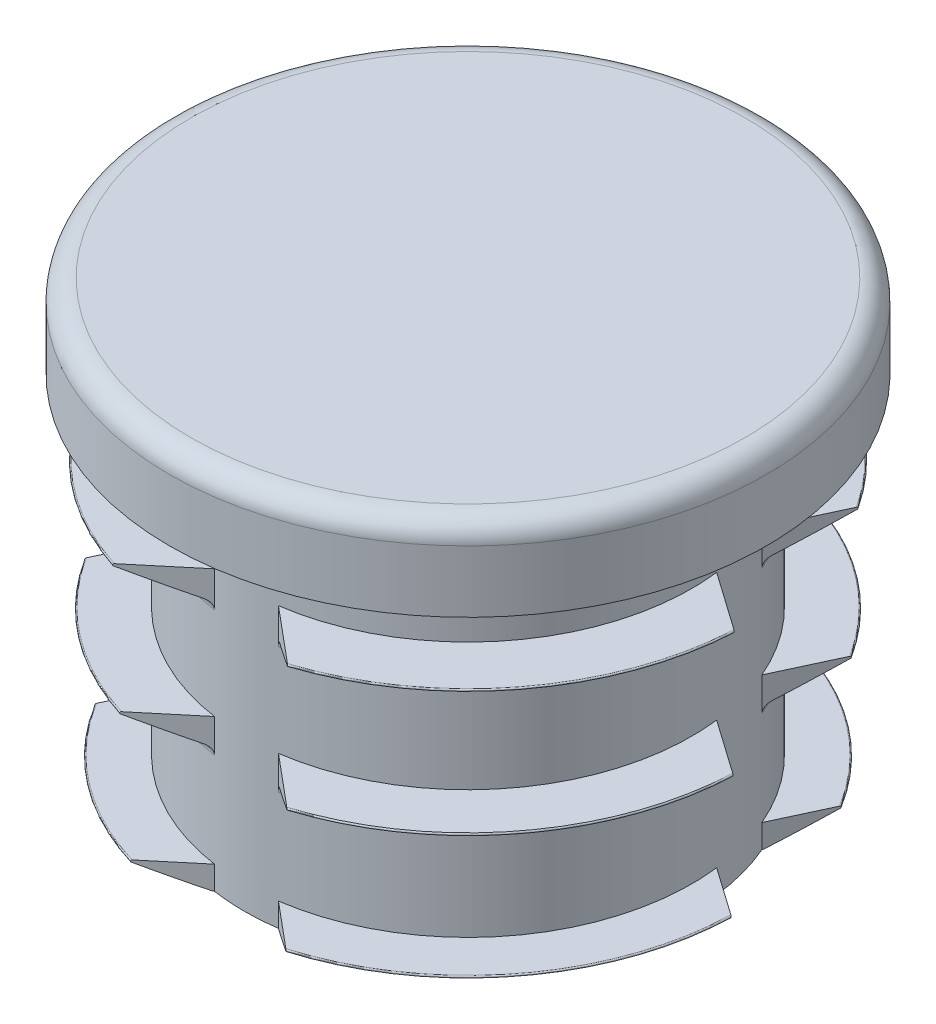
from build123d import *

# Parameters (mm, degrees)
SKETCH_1_R                      = 14
EXTRUDE_1_DEPTH                 = 1.95
SKETCH_2_R                      = 10.5
SKETCH_2_R_2                    = 8.5
EXTRUDE_2_DEPTH                 = 16.6
FILLET_1_R                      = 1
FILLET_2_R                      = 0.05
FILLET_3_R                      = 0.5
CUT_EXTRUDE_1_REACH             = 30.5
PATTERN_CIRCULAR_1_COUNT        = 2
PATTERN_CIRCULAR_1_ANGLE        = 75
PATTERN_CIRCULAR_2_COUNT        = 2
PATTERN_CIRCULAR_2_COPY_1_REACH = 30.5


with BuildPart() as part:
    # Sketch 1 → Extrude 1 (new, symmetric)
    with BuildSketch(Plane(origin=(0, 0, 0), x_dir=(1, 0, 0), z_dir=(0, 1, 0))):
        with Locations(Location((0, 0, 0), (0, 0, 270))):
            Circle(SKETCH_1_R)
    extrude(amount=EXTRUDE_1_DEPTH, both=True)

    # Sketch 2 → Extrude 2 (add)
    with BuildSketch(Plane.XZ.offset(1.95)):
        with Locations(Location((0, 0, 0), (0, 0, 90))):
            Circle(SKETCH_2_R)
        with Locations(Location((0, 0, 0), (0, 0, 90))):
            Circle(SKETCH_2_R_2, mode=Mode.SUBTRACT)
    extrude(amount=EXTRUDE_2_DEPTH)

    # Sketch 3 → Revolve 1 (revolve)
    with BuildSketch(Plane(origin=(0, 0, 0), x_dir=(0, 0, -1), z_dir=(1, 0, 0))):
        Polygon((-12.9, -17.430862), (-10.5, -18.55), (-10.5, -17.430862), align=None)
        Polygon((-13.4, -5.430862), (-10.5, -6.783154), (-10.5, -5.430862), align=None)
        Polygon((-13.2, -11.430862), (-10.5, -12.689892), (-10.5, -11.430862), align=None)
    revolve(axis=Axis((0, -18.55, 0), (0, 1, 0)))

    # Fillet 1
    fillet_1_edges = [part.edges().sort_by_distance(p)[0] for p in [
        (0, 1.95, -14),
    ]]
    fillet(fillet_1_edges, radius=FILLET_1_R)

    # Fillet 2
    fillet_2_edges = [part.edges().sort_by_distance(p)[0] for p in [
        (0, -17.430862, -12.9),
        (0, -11.430862, -13.2),
        (0, -5.430862, -13.4),
    ]]
    fillet(fillet_2_edges, radius=FILLET_2_R)

    # Fillet 3
    fillet_3_edges = [part.edges().sort_by_distance(p)[0] for p in [
        (0, -18.55, -10.5),
        (0, -12.689892, -10.5),
        (0, -6.783154, -10.5),
    ]]
    fillet(fillet_3_edges, radius=FILLET_3_R)

    # Cut-Extrude 1: up to this face of the body (flat: up to its plane)
    cut_extrude_1_end = Plane(part.part.faces().sort_by_distance((0, -1.95, -13.60402))[0])
    # Sketch 4 → Cut-Extrude 1 (cut, up to the picked face)
    with BuildSketch(Plane.XZ.offset(18.55), mode=Mode.PRIVATE) as cut_extrude_1_sk1:
        with BuildLine():
            Line((-1.5, 10.392305), (-13, 20))
            Line((-13, 20), (13, 20))
            Line((13, 20), (1.5, 10.392305))
            ThreePointArc((1.5, 10.392305), (0, 10.5), (-1.5, 10.392305))
        make_face()
    cut_extrude_1_tool1 = split(extrude(cut_extrude_1_sk1.sketch, amount=-CUT_EXTRUDE_1_REACH, mode=Mode.PRIVATE), bisect_by=cut_extrude_1_end, keep=Keep.BOTH, mode=Mode.PRIVATE)
    cut_extrude_1 = cut_extrude_1_tool1.solids().sort_by(Axis((0, -18.55, 16.475483), (0, 1, 0)))[0]
    add(cut_extrude_1, mode=Mode.SUBTRACT)

    # Pattern Circular 1: Cut-Extrude 1 ×2 about axis
    pattern_circular_1_axis = Axis((0, 0, 0), (0, -1, 0))
    for i in range(1, PATTERN_CIRCULAR_1_COUNT):
        add(cut_extrude_1.rotate(pattern_circular_1_axis, i * PATTERN_CIRCULAR_1_ANGLE / (PATTERN_CIRCULAR_1_COUNT - 1)), mode=Mode.SUBTRACT)

    # Pattern Circular 2: Cut-Extrude 1 ×2 about axis
    pattern_circular_2_axis = Axis((0, 0, 0), (0, 1, 0))
    for i in range(1, PATTERN_CIRCULAR_2_COUNT):
        add(cut_extrude_1.rotate(pattern_circular_2_axis, i * 360 / PATTERN_CIRCULAR_2_COUNT), mode=Mode.SUBTRACT)

    # Pattern Circular 2 copy 1: up to this face of the body (flat: up to its plane)
    pattern_circular_2_copy_1_end = Plane(part.part.faces().sort_by_distance((-13.140474, -1.95, 3.52098))[0])
    # Pattern Circular 2 copy 1 sketch → Pattern Circular 2 copy 1 (cut, up to the picked face)
    with BuildSketch(Plane(origin=(0, -18.55, 0), x_dir=(-0.25881904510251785, 0, -0.9659258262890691), z_dir=(0, -1, 0)), mode=Mode.PRIVATE) as pattern_circular_2_copy_1_sk1:
        with BuildLine():
            Line((-1.5, 10.392305), (-13, 20))
            Line((-13, 20), (13, 20))
            Line((13, 20), (1.5, 10.392305))
            ThreePointArc((1.5, 10.392305), (0, 10.5), (-1.5, 10.392305))
        make_face()
    pattern_circular_2_copy_1_tool1 = split(extrude(pattern_circular_2_copy_1_sk1.sketch, amount=-PATTERN_CIRCULAR_2_COPY_1_REACH, mode=Mode.PRIVATE), bisect_by=pattern_circular_2_copy_1_end, keep=Keep.BOTH, mode=Mode.PRIVATE)
    add(pattern_circular_2_copy_1_tool1.solids().sort_by(Axis((15.914095, -18.55, -4.264169), (0, 1, 0)))[0], mode=Mode.SUBTRACT)


solid = part.part
